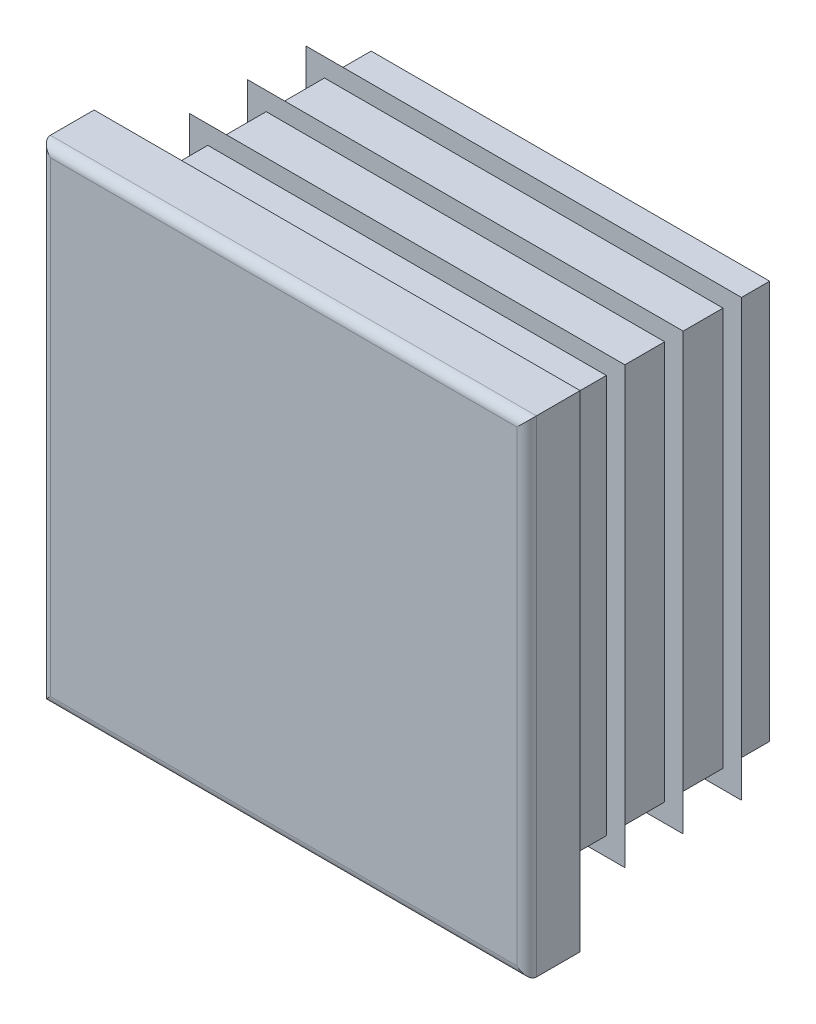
ISO-10303-21;
HEADER;
FILE_DESCRIPTION(('STEP AP214'),'2;1');
FILE_NAME('part.step','',(''),(''),'','','');
FILE_SCHEMA(('AUTOMOTIVE_DESIGN { 1 0 10303 214 1 1 1 1 }'));
ENDSEC;
DATA;
#1=APPLICATION_CONTEXT('core data for automotive mechanical design processes');
#2=APPLICATION_PROTOCOL_DEFINITION('international standard','automotive_design',2000,#1);
#3=PRODUCT_CONTEXT('',#1,'mechanical');
#4=PRODUCT('Part','Part','',(#3));
#5=PRODUCT_RELATED_PRODUCT_CATEGORY('part','',(#4));
#6=PRODUCT_DEFINITION_FORMATION('','',#4);
#7=PRODUCT_DEFINITION_CONTEXT('part definition',#1,'design');
#8=PRODUCT_DEFINITION('design','',#6,#7);
#9=PRODUCT_DEFINITION_SHAPE('','',#8);
#10=(LENGTH_UNIT() NAMED_UNIT(*) SI_UNIT(.MILLI.,.METRE.));
#11=(NAMED_UNIT(*) PLANE_ANGLE_UNIT() SI_UNIT($,.RADIAN.));
#12=(NAMED_UNIT(*) SI_UNIT($,.STERADIAN.) SOLID_ANGLE_UNIT());
#13=UNCERTAINTY_MEASURE_WITH_UNIT(LENGTH_MEASURE(1.E-05),#10,'distance_accuracy_value','');
#14=(GEOMETRIC_REPRESENTATION_CONTEXT(3) GLOBAL_UNCERTAINTY_ASSIGNED_CONTEXT((#13)) GLOBAL_UNIT_ASSIGNED_CONTEXT((#10,
#11,#12)) REPRESENTATION_CONTEXT('',''));
#15=CARTESIAN_POINT('',(0.,0.,0.));
#16=DIRECTION('',(0.,0.,1.));
#17=DIRECTION('',(1.,0.,0.));
#18=AXIS2_PLACEMENT_3D('',#15,#16,#17);
#19=CARTESIAN_POINT('',(24.,-25.,5.5));
#20=DIRECTION('',(0.,0.,-1.));
#21=DIRECTION('',(0.,1.,0.));
#22=AXIS2_PLACEMENT_3D('',#19,#20,#21);
#23=PLANE('',#22);
#24=DIRECTION('',(0.,1.,0.));
#25=VECTOR('',#24,1.);
#26=CARTESIAN_POINT('',(-24.,-25.,5.5));
#27=LINE('',#26,#25);
#28=CARTESIAN_POINT('',(-24.,-24.,5.5));
#29=VERTEX_POINT('',#28);
#30=CARTESIAN_POINT('',(-24.,24.,5.5));
#31=VERTEX_POINT('',#30);
#32=EDGE_CURVE('E262',#29,#31,#27,.T.);
#33=ORIENTED_EDGE('',*,*,#32,.F.);
#34=DIRECTION('',(-1.,0.,0.));
#35=VECTOR('',#34,1.);
#36=CARTESIAN_POINT('',(25.,-24.,5.5));
#37=LINE('',#36,#35);
#38=CARTESIAN_POINT('',(24.,-24.,5.5));
#39=VERTEX_POINT('',#38);
#40=EDGE_CURVE('E432',#39,#29,#37,.T.);
#41=ORIENTED_EDGE('',*,*,#40,.F.);
#42=DIRECTION('',(0.,1.,0.));
#43=VECTOR('',#42,1.);
#44=CARTESIAN_POINT('',(24.,-25.,5.5));
#45=LINE('',#44,#43);
#46=CARTESIAN_POINT('',(24.,24.,5.5));
#47=VERTEX_POINT('',#46);
#48=EDGE_CURVE('E257',#39,#47,#45,.T.);
#49=ORIENTED_EDGE('',*,*,#48,.T.);
#50=DIRECTION('',(-1.,0.,0.));
#51=VECTOR('',#50,1.);
#52=CARTESIAN_POINT('',(25.,24.,5.5));
#53=LINE('',#52,#51);
#54=EDGE_CURVE('E534',#47,#31,#53,.T.);
#55=ORIENTED_EDGE('',*,*,#54,.T.);
#56=EDGE_LOOP('',(#33,#41,#49,#55));
#57=FACE_BOUND('',#56,.T.);
#58=ADVANCED_FACE('F14',(#57),#23,.F.);
#59=CARTESIAN_POINT('',(-24.,-25.,4.5));
#60=DIRECTION('',(0.,1.,0.));
#61=DIRECTION('',(-1.,0.,0.));
#62=AXIS2_PLACEMENT_3D('',#59,#60,#61);
#63=CYLINDRICAL_SURFACE('',#62,1.);
#64=DIRECTION('',(0.,1.,0.));
#65=VECTOR('',#64,1.);
#66=CARTESIAN_POINT('',(-25.,-25.,4.5));
#67=LINE('',#66,#65);
#68=CARTESIAN_POINT('',(-25.,-25.,4.5));
#69=VERTEX_POINT('',#68);
#70=CARTESIAN_POINT('',(-25.,25.,4.5));
#71=VERTEX_POINT('',#70);
#72=EDGE_CURVE('E354',#69,#71,#67,.T.);
#73=ORIENTED_EDGE('',*,*,#72,.F.);
#74=CARTESIAN_POINT('',(-24.,-24.,4.5));
#75=DIRECTION('',(-0.707106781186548,0.707106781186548,0.));
#76=DIRECTION('',(0.707106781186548,0.707106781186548,0.));
#77=AXIS2_PLACEMENT_3D('',#74,#75,#76);
#78=ELLIPSE('',#77,1.4142135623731,1.);
#79=EDGE_CURVE('E59',#69,#29,#78,.T.);
#80=ORIENTED_EDGE('',*,*,#79,.T.);
#81=ORIENTED_EDGE('',*,*,#32,.T.);
#82=CARTESIAN_POINT('',(-24.,24.,4.5));
#83=DIRECTION('',(0.707106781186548,0.707106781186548,0.));
#84=DIRECTION('',(-0.707106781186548,0.707106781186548,0.));
#85=AXIS2_PLACEMENT_3D('',#82,#83,#84);
#86=ELLIPSE('',#85,1.4142135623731,1.);
#87=EDGE_CURVE('E258',#31,#71,#86,.F.);
#88=ORIENTED_EDGE('',*,*,#87,.T.);
#89=EDGE_LOOP('',(#73,#80,#81,#88));
#90=FACE_BOUND('',#89,.T.);
#91=ADVANCED_FACE('F16',(#90),#63,.T.);
#92=CARTESIAN_POINT('',(-25.,-25.,4.5));
#93=DIRECTION('',(1.,0.,0.));
#94=DIRECTION('',(0.,1.,0.));
#95=AXIS2_PLACEMENT_3D('',#92,#93,#94);
#96=PLANE('',#95);
#97=DIRECTION('',(0.,0.,-1.));
#98=VECTOR('',#97,1.);
#99=CARTESIAN_POINT('',(-25.,25.,4.5));
#100=LINE('',#99,#98);
#101=CARTESIAN_POINT('',(-25.,25.,0.));
#102=VERTEX_POINT('',#101);
#103=EDGE_CURVE('E519',#71,#102,#100,.T.);
#104=ORIENTED_EDGE('',*,*,#103,.T.);
#105=DIRECTION('',(0.,1.,0.));
#106=VECTOR('',#105,1.);
#107=CARTESIAN_POINT('',(-25.,-25.,0.));
#108=LINE('',#107,#106);
#109=CARTESIAN_POINT('',(-25.,-25.,0.));
#110=VERTEX_POINT('',#109);
#111=EDGE_CURVE('E352',#110,#102,#108,.T.);
#112=ORIENTED_EDGE('',*,*,#111,.F.);
#113=DIRECTION('',(0.,0.,-1.));
#114=VECTOR('',#113,1.);
#115=CARTESIAN_POINT('',(-25.,-25.,4.5));
#116=LINE('',#115,#114);
#117=EDGE_CURVE('E520',#69,#110,#116,.T.);
#118=ORIENTED_EDGE('',*,*,#117,.F.);
#119=ORIENTED_EDGE('',*,*,#72,.T.);
#120=EDGE_LOOP('',(#104,#112,#118,#119));
#121=FACE_BOUND('',#120,.T.);
#122=ADVANCED_FACE('F604',(#121),#96,.F.);
#123=CARTESIAN_POINT('',(-20.5,-25.,0.));
#124=DIRECTION('',(1.,0.,0.));
#125=DIRECTION('',(0.,1.,0.));
#126=AXIS2_PLACEMENT_3D('',#123,#124,#125);
#127=PLANE('',#126);
#128=DIRECTION('',(0.,1.,0.));
#129=VECTOR('',#128,1.);
#130=CARTESIAN_POINT('',(-20.5,-25.,0.));
#131=LINE('',#130,#129);
#132=CARTESIAN_POINT('',(-20.5,-20.5,0.));
#133=VERTEX_POINT('',#132);
#134=CARTESIAN_POINT('',(-20.5,20.5,0.));
#135=VERTEX_POINT('',#134);
#136=EDGE_CURVE('E349',#133,#135,#131,.T.);
#137=ORIENTED_EDGE('',*,*,#136,.T.);
#138=DIRECTION('',(0.,0.,-1.));
#139=VECTOR('',#138,1.);
#140=CARTESIAN_POINT('',(-20.5,20.5,0.));
#141=LINE('',#140,#139);
#142=CARTESIAN_POINT('',(-20.5,20.5,-1.2));
#143=VERTEX_POINT('',#142);
#144=EDGE_CURVE('E445',#135,#143,#141,.T.);
#145=ORIENTED_EDGE('',*,*,#144,.T.);
#146=DIRECTION('',(0.,1.,0.));
#147=VECTOR('',#146,1.);
#148=CARTESIAN_POINT('',(-20.5,-25.,-1.2));
#149=LINE('',#148,#147);
#150=CARTESIAN_POINT('',(-20.5,-20.5,-1.2));
#151=VERTEX_POINT('',#150);
#152=EDGE_CURVE('E346',#151,#143,#149,.T.);
#153=ORIENTED_EDGE('',*,*,#152,.F.);
#154=DIRECTION('',(0.,0.,1.));
#155=VECTOR('',#154,1.);
#156=CARTESIAN_POINT('',(-20.5,-20.5,0.));
#157=LINE('',#156,#155);
#158=EDGE_CURVE('E439',#151,#133,#157,.T.);
#159=ORIENTED_EDGE('',*,*,#158,.T.);
#160=EDGE_LOOP('',(#137,#145,#153,#159));
#161=FACE_BOUND('',#160,.T.);
#162=ADVANCED_FACE('F728',(#161),#127,.F.);
#163=CARTESIAN_POINT('',(-22.4,-25.,-1.2));
#164=DIRECTION('',(0.573576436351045,0.,0.819152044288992));
#165=DIRECTION('',(-0.819152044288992,0.,0.573576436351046));
#166=AXIS2_PLACEMENT_3D('',#163,#164,#165);
#167=PLANE('',#166);
#168=DIRECTION('',(0.,1.,0.));
#169=VECTOR('',#168,1.);
#170=CARTESIAN_POINT('',(-22.4,-25.,-1.2));
#171=LINE('',#170,#169);
#172=CARTESIAN_POINT('',(-22.4,-22.4,-1.2));
#173=VERTEX_POINT('',#172);
#174=CARTESIAN_POINT('',(-22.4,22.4,-1.2));
#175=VERTEX_POINT('',#174);
#176=EDGE_CURVE('E344',#173,#175,#171,.T.);
#177=ORIENTED_EDGE('',*,*,#176,.T.);
#178=DIRECTION('',(0.633687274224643,-0.633687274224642,-0.443712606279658));
#179=VECTOR('',#178,1.);
#180=CARTESIAN_POINT('',(-3.36607678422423,3.36607678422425,-14.527696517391));
#181=LINE('',#180,#179);
#182=CARTESIAN_POINT('',(-20.5,20.5,-2.53039432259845));
#183=VERTEX_POINT('',#182);
#184=EDGE_CURVE('E457',#175,#183,#181,.T.);
#185=ORIENTED_EDGE('',*,*,#184,.T.);
#186=DIRECTION('',(0.,1.,0.));
#187=VECTOR('',#186,1.);
#188=CARTESIAN_POINT('',(-20.5,-25.,-2.53039432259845));
#189=LINE('',#188,#187);
#190=CARTESIAN_POINT('',(-20.5,-20.5,-2.53039432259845));
#191=VERTEX_POINT('',#190);
#192=EDGE_CURVE('E341',#191,#183,#189,.T.);
#193=ORIENTED_EDGE('',*,*,#192,.F.);
#194=DIRECTION('',(-0.633687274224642,-0.633687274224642,0.443712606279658));
#195=VECTOR('',#194,1.);
#196=CARTESIAN_POINT('',(-23.444054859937,-23.444054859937,-0.468944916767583));
#197=LINE('',#196,#195);
#198=EDGE_CURVE('E451',#191,#173,#197,.T.);
#199=ORIENTED_EDGE('',*,*,#198,.T.);
#200=EDGE_LOOP('',(#177,#185,#193,#199));
#201=FACE_BOUND('',#200,.T.);
#202=ADVANCED_FACE('F732',(#201),#167,.F.);
#203=CARTESIAN_POINT('',(-20.5,-25.,-2.53039432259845));
#204=DIRECTION('',(1.,0.,0.));
#205=DIRECTION('',(0.,1.,0.));
#206=AXIS2_PLACEMENT_3D('',#203,#204,#205);
#207=PLANE('',#206);
#208=ORIENTED_EDGE('',*,*,#192,.T.);
#209=DIRECTION('',(0.,0.,-1.));
#210=VECTOR('',#209,1.);
#211=CARTESIAN_POINT('',(-20.5,20.5,-2.53039432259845));
#212=LINE('',#211,#210);
#213=CARTESIAN_POINT('',(-20.5,20.5,-7.2));
#214=VERTEX_POINT('',#213);
#215=EDGE_CURVE('E463',#183,#214,#212,.T.);
#216=ORIENTED_EDGE('',*,*,#215,.T.);
#217=DIRECTION('',(0.,1.,0.));
#218=VECTOR('',#217,1.);
#219=CARTESIAN_POINT('',(-20.5,-25.,-7.2));
#220=LINE('',#219,#218);
#221=CARTESIAN_POINT('',(-20.5,-20.5,-7.2));
#222=VERTEX_POINT('',#221);
#223=EDGE_CURVE('E338',#222,#214,#220,.T.);
#224=ORIENTED_EDGE('',*,*,#223,.F.);
#225=DIRECTION('',(0.,0.,1.));
#226=VECTOR('',#225,1.);
#227=CARTESIAN_POINT('',(-20.5,-20.5,-2.53039432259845));
#228=LINE('',#227,#226);
#229=EDGE_CURVE('E460',#222,#191,#228,.T.);
#230=ORIENTED_EDGE('',*,*,#229,.T.);
#231=EDGE_LOOP('',(#208,#216,#224,#230));
#232=FACE_BOUND('',#231,.T.);
#233=ADVANCED_FACE('F738',(#232),#207,.F.);
#234=CARTESIAN_POINT('',(-22.4,-25.,-7.2));
#235=DIRECTION('',(0.573576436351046,0.,0.819152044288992));
#236=DIRECTION('',(-0.819152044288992,0.,0.573576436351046));
#237=AXIS2_PLACEMENT_3D('',#234,#235,#236);
#238=PLANE('',#237);
#239=DIRECTION('',(0.,1.,0.));
#240=VECTOR('',#239,1.);
#241=CARTESIAN_POINT('',(-22.4,-25.,-7.2));
#242=LINE('',#241,#240);
#243=CARTESIAN_POINT('',(-22.4,-22.4,-7.2));
#244=VERTEX_POINT('',#243);
#245=CARTESIAN_POINT('',(-22.4,22.4,-7.2));
#246=VERTEX_POINT('',#245);
#247=EDGE_CURVE('E336',#244,#246,#242,.T.);
#248=ORIENTED_EDGE('',*,*,#247,.T.);
#249=DIRECTION('',(0.633687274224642,-0.633687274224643,-0.443712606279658));
#250=VECTOR('',#249,1.);
#251=CARTESIAN_POINT('',(-3.36607678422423,3.3660767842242,-20.527696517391));
#252=LINE('',#251,#250);
#253=CARTESIAN_POINT('',(-20.5,20.5,-8.53039432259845));
#254=VERTEX_POINT('',#253);
#255=EDGE_CURVE('E475',#246,#254,#252,.T.);
#256=ORIENTED_EDGE('',*,*,#255,.T.);
#257=DIRECTION('',(0.,1.,0.));
#258=VECTOR('',#257,1.);
#259=CARTESIAN_POINT('',(-20.5,-25.,-8.53039432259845));
#260=LINE('',#259,#258);
#261=CARTESIAN_POINT('',(-20.5,-20.5,-8.53039432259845));
#262=VERTEX_POINT('',#261);
#263=EDGE_CURVE('E333',#262,#254,#260,.T.);
#264=ORIENTED_EDGE('',*,*,#263,.F.);
#265=DIRECTION('',(-0.633687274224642,-0.633687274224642,0.443712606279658));
#266=VECTOR('',#265,1.);
#267=CARTESIAN_POINT('',(-23.444054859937,-23.444054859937,-6.46894491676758));
#268=LINE('',#267,#266);
#269=EDGE_CURVE('E469',#262,#244,#268,.T.);
#270=ORIENTED_EDGE('',*,*,#269,.T.);
#271=EDGE_LOOP('',(#248,#256,#264,#270));
#272=FACE_BOUND('',#271,.T.);
#273=ADVANCED_FACE('F742',(#272),#238,.F.);
#274=CARTESIAN_POINT('',(-20.5,-25.,-8.53039432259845));
#275=DIRECTION('',(1.,0.,0.));
#276=DIRECTION('',(0.,1.,0.));
#277=AXIS2_PLACEMENT_3D('',#274,#275,#276);
#278=PLANE('',#277);
#279=ORIENTED_EDGE('',*,*,#263,.T.);
#280=DIRECTION('',(0.,0.,-1.));
#281=VECTOR('',#280,1.);
#282=CARTESIAN_POINT('',(-20.5,20.5,-8.53039432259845));
#283=LINE('',#282,#281);
#284=CARTESIAN_POINT('',(-20.5,20.5,-13.2));
#285=VERTEX_POINT('',#284);
#286=EDGE_CURVE('E481',#254,#285,#283,.T.);
#287=ORIENTED_EDGE('',*,*,#286,.T.);
#288=DIRECTION('',(0.,1.,0.));
#289=VECTOR('',#288,1.);
#290=CARTESIAN_POINT('',(-20.5,-25.,-13.2));
#291=LINE('',#290,#289);
#292=CARTESIAN_POINT('',(-20.5,-20.5,-13.2));
#293=VERTEX_POINT('',#292);
#294=EDGE_CURVE('E330',#293,#285,#291,.T.);
#295=ORIENTED_EDGE('',*,*,#294,.F.);
#296=DIRECTION('',(0.,0.,1.));
#297=VECTOR('',#296,1.);
#298=CARTESIAN_POINT('',(-20.5,-20.5,-8.53039432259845));
#299=LINE('',#298,#297);
#300=EDGE_CURVE('E478',#293,#262,#299,.T.);
#301=ORIENTED_EDGE('',*,*,#300,.T.);
#302=EDGE_LOOP('',(#279,#287,#295,#301));
#303=FACE_BOUND('',#302,.T.);
#304=ADVANCED_FACE('F746',(#303),#278,.F.);
#305=CARTESIAN_POINT('',(-22.4,-25.,-13.2));
#306=DIRECTION('',(0.573576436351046,0.,0.819152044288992));
#307=DIRECTION('',(-0.819152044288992,0.,0.573576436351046));
#308=AXIS2_PLACEMENT_3D('',#305,#306,#307);
#309=PLANE('',#308);
#310=DIRECTION('',(0.,1.,0.));
#311=VECTOR('',#310,1.);
#312=CARTESIAN_POINT('',(-22.4,-25.,-13.2));
#313=LINE('',#312,#311);
#314=CARTESIAN_POINT('',(-22.4,-22.4,-13.2));
#315=VERTEX_POINT('',#314);
#316=CARTESIAN_POINT('',(-22.4,22.4,-13.2));
#317=VERTEX_POINT('',#316);
#318=EDGE_CURVE('E328',#315,#317,#313,.T.);
#319=ORIENTED_EDGE('',*,*,#318,.T.);
#320=DIRECTION('',(0.633687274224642,-0.633687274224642,-0.443712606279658));
#321=VECTOR('',#320,1.);
#322=CARTESIAN_POINT('',(-3.36607678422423,3.36607678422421,-26.527696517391));
#323=LINE('',#322,#321);
#324=CARTESIAN_POINT('',(-20.5,20.5,-14.5303943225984));
#325=VERTEX_POINT('',#324);
#326=EDGE_CURVE('E493',#317,#325,#323,.T.);
#327=ORIENTED_EDGE('',*,*,#326,.T.);
#328=DIRECTION('',(0.,1.,0.));
#329=VECTOR('',#328,1.);
#330=CARTESIAN_POINT('',(-20.5,-25.,-14.5303943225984));
#331=LINE('',#330,#329);
#332=CARTESIAN_POINT('',(-20.5,-20.5,-14.5303943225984));
#333=VERTEX_POINT('',#332);
#334=EDGE_CURVE('E325',#333,#325,#331,.T.);
#335=ORIENTED_EDGE('',*,*,#334,.F.);
#336=DIRECTION('',(-0.633687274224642,-0.633687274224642,0.443712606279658));
#337=VECTOR('',#336,1.);
#338=CARTESIAN_POINT('',(-23.444054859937,-23.444054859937,-12.4689449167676));
#339=LINE('',#338,#337);
#340=EDGE_CURVE('E487',#333,#315,#339,.T.);
#341=ORIENTED_EDGE('',*,*,#340,.T.);
#342=EDGE_LOOP('',(#319,#327,#335,#341));
#343=FACE_BOUND('',#342,.T.);
#344=ADVANCED_FACE('F668',(#343),#309,.F.);
#345=CARTESIAN_POINT('',(-20.5,-25.,-14.5303943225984));
#346=DIRECTION('',(1.,0.,0.));
#347=DIRECTION('',(0.,1.,0.));
#348=AXIS2_PLACEMENT_3D('',#345,#346,#347);
#349=PLANE('',#348);
#350=ORIENTED_EDGE('',*,*,#334,.T.);
#351=DIRECTION('',(0.,0.,-1.));
#352=VECTOR('',#351,1.);
#353=CARTESIAN_POINT('',(-20.5,20.5,-14.5303943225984));
#354=LINE('',#353,#352);
#355=CARTESIAN_POINT('',(-20.5,20.5,-19.2));
#356=VERTEX_POINT('',#355);
#357=EDGE_CURVE('E499',#325,#356,#354,.T.);
#358=ORIENTED_EDGE('',*,*,#357,.T.);
#359=DIRECTION('',(0.,1.,0.));
#360=VECTOR('',#359,1.);
#361=CARTESIAN_POINT('',(-20.5,-25.,-19.2));
#362=LINE('',#361,#360);
#363=CARTESIAN_POINT('',(-20.5,-20.5,-19.2));
#364=VERTEX_POINT('',#363);
#365=EDGE_CURVE('E322',#364,#356,#362,.T.);
#366=ORIENTED_EDGE('',*,*,#365,.F.);
#367=DIRECTION('',(0.,0.,1.));
#368=VECTOR('',#367,1.);
#369=CARTESIAN_POINT('',(-20.5,-20.5,-14.5303943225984));
#370=LINE('',#369,#368);
#371=EDGE_CURVE('E496',#364,#333,#370,.T.);
#372=ORIENTED_EDGE('',*,*,#371,.T.);
#373=EDGE_LOOP('',(#350,#358,#366,#372));
#374=FACE_BOUND('',#373,.T.);
#375=ADVANCED_FACE('F665',(#374),#349,.F.);
#376=CARTESIAN_POINT('',(-22.4,-25.,-19.2));
#377=DIRECTION('',(0.573576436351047,0.,0.819152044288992));
#378=DIRECTION('',(-0.819152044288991,0.,0.573576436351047));
#379=AXIS2_PLACEMENT_3D('',#376,#377,#378);
#380=PLANE('',#379);
#381=DIRECTION('',(0.,1.,0.));
#382=VECTOR('',#381,1.);
#383=CARTESIAN_POINT('',(-22.4,-25.,-19.2));
#384=LINE('',#383,#382);
#385=CARTESIAN_POINT('',(-22.4,-22.4,-19.2));
#386=VERTEX_POINT('',#385);
#387=CARTESIAN_POINT('',(-22.4,22.4,-19.2));
#388=VERTEX_POINT('',#387);
#389=EDGE_CURVE('E320',#386,#388,#384,.T.);
#390=ORIENTED_EDGE('',*,*,#389,.T.);
#391=DIRECTION('',(0.633687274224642,-0.633687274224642,-0.443712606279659));
#392=VECTOR('',#391,1.);
#393=CARTESIAN_POINT('',(-3.36607678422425,3.36607678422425,-32.527696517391));
#394=LINE('',#393,#392);
#395=CARTESIAN_POINT('',(-20.5,20.5,-20.5303943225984));
#396=VERTEX_POINT('',#395);
#397=EDGE_CURVE('E511',#388,#396,#394,.T.);
#398=ORIENTED_EDGE('',*,*,#397,.T.);
#399=DIRECTION('',(0.,1.,0.));
#400=VECTOR('',#399,1.);
#401=CARTESIAN_POINT('',(-20.5,-25.,-20.5303943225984));
#402=LINE('',#401,#400);
#403=CARTESIAN_POINT('',(-20.5,-20.5,-20.5303943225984));
#404=VERTEX_POINT('',#403);
#405=EDGE_CURVE('E317',#404,#396,#402,.T.);
#406=ORIENTED_EDGE('',*,*,#405,.F.);
#407=DIRECTION('',(-0.633687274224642,-0.633687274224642,0.443712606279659));
#408=VECTOR('',#407,1.);
#409=CARTESIAN_POINT('',(-23.444054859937,-23.444054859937,-18.4689449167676));
#410=LINE('',#409,#408);
#411=EDGE_CURVE('E505',#404,#386,#410,.T.);
#412=ORIENTED_EDGE('',*,*,#411,.T.);
#413=EDGE_LOOP('',(#390,#398,#406,#412));
#414=FACE_BOUND('',#413,.T.);
#415=ADVANCED_FACE('F580',(#414),#380,.F.);
#416=CARTESIAN_POINT('',(-20.5,-25.,-20.5303943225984));
#417=DIRECTION('',(1.,0.,0.));
#418=DIRECTION('',(0.,1.,0.));
#419=AXIS2_PLACEMENT_3D('',#416,#417,#418);
#420=PLANE('',#419);
#421=ORIENTED_EDGE('',*,*,#405,.T.);
#422=DIRECTION('',(0.,0.,-1.));
#423=VECTOR('',#422,1.);
#424=CARTESIAN_POINT('',(-20.5,20.5,-20.5303943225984));
#425=LINE('',#424,#423);
#426=CARTESIAN_POINT('',(-20.5,20.5,-24.));
#427=VERTEX_POINT('',#426);
#428=EDGE_CURVE('E517',#396,#427,#425,.T.);
#429=ORIENTED_EDGE('',*,*,#428,.T.);
#430=DIRECTION('',(0.,1.,0.));
#431=VECTOR('',#430,1.);
#432=CARTESIAN_POINT('',(-20.5,-25.,-24.));
#433=LINE('',#432,#431);
#434=CARTESIAN_POINT('',(-20.5,-20.5,-24.));
#435=VERTEX_POINT('',#434);
#436=EDGE_CURVE('E314',#435,#427,#433,.T.);
#437=ORIENTED_EDGE('',*,*,#436,.F.);
#438=DIRECTION('',(0.,0.,1.));
#439=VECTOR('',#438,1.);
#440=CARTESIAN_POINT('',(-20.5,-20.5,-20.5303943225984));
#441=LINE('',#440,#439);
#442=EDGE_CURVE('E514',#435,#404,#441,.T.);
#443=ORIENTED_EDGE('',*,*,#442,.T.);
#444=EDGE_LOOP('',(#421,#429,#437,#443));
#445=FACE_BOUND('',#444,.T.);
#446=ADVANCED_FACE('F582',(#445),#420,.F.);
#447=CARTESIAN_POINT('',(-20.5,-25.,-24.));
#448=DIRECTION('',(0.,0.,1.));
#449=DIRECTION('',(0.,-1.,0.));
#450=AXIS2_PLACEMENT_3D('',#447,#448,#449);
#451=PLANE('',#450);
#452=ORIENTED_EDGE('',*,*,#436,.T.);
#453=DIRECTION('',(-1.,0.,0.));
#454=VECTOR('',#453,1.);
#455=CARTESIAN_POINT('',(25.,20.5,-24.));
#456=LINE('',#455,#454);
#457=CARTESIAN_POINT('',(20.5,20.5,-24.));
#458=VERTEX_POINT('',#457);
#459=EDGE_CURVE('E388',#458,#427,#456,.T.);
#460=ORIENTED_EDGE('',*,*,#459,.F.);
#461=DIRECTION('',(0.,1.,0.));
#462=VECTOR('',#461,1.);
#463=CARTESIAN_POINT('',(20.5,-25.,-24.));
#464=LINE('',#463,#462);
#465=CARTESIAN_POINT('',(20.5,-20.5,-24.));
#466=VERTEX_POINT('',#465);
#467=EDGE_CURVE('E311',#466,#458,#464,.T.);
#468=ORIENTED_EDGE('',*,*,#467,.F.);
#469=DIRECTION('',(-1.,0.,0.));
#470=VECTOR('',#469,1.);
#471=CARTESIAN_POINT('',(25.,-20.5,-24.));
#472=LINE('',#471,#470);
#473=EDGE_CURVE('E386',#466,#435,#472,.T.);
#474=ORIENTED_EDGE('',*,*,#473,.T.);
#475=EDGE_LOOP('',(#452,#460,#468,#474));
#476=FACE_BOUND('',#475,.T.);
#477=ADVANCED_FACE('F385',(#476),#451,.F.);
#478=CARTESIAN_POINT('',(20.5,-25.,-24.));
#479=DIRECTION('',(-1.,0.,0.));
#480=DIRECTION('',(0.,-1.,0.));
#481=AXIS2_PLACEMENT_3D('',#478,#479,#480);
#482=PLANE('',#481);
#483=ORIENTED_EDGE('',*,*,#467,.T.);
#484=DIRECTION('',(0.,0.,1.));
#485=VECTOR('',#484,1.);
#486=CARTESIAN_POINT('',(20.5,20.5,-24.));
#487=LINE('',#486,#485);
#488=CARTESIAN_POINT('',(20.5,20.5,-20.5303943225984));
#489=VERTEX_POINT('',#488);
#490=EDGE_CURVE('E9',#458,#489,#487,.T.);
#491=ORIENTED_EDGE('',*,*,#490,.T.);
#492=DIRECTION('',(0.,1.,0.));
#493=VECTOR('',#492,1.);
#494=CARTESIAN_POINT('',(20.5,-25.,-20.5303943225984));
#495=LINE('',#494,#493);
#496=CARTESIAN_POINT('',(20.5,-20.5,-20.5303943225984));
#497=VERTEX_POINT('',#496);
#498=EDGE_CURVE('E308',#497,#489,#495,.T.);
#499=ORIENTED_EDGE('',*,*,#498,.F.);
#500=DIRECTION('',(0.,0.,-1.));
#501=VECTOR('',#500,1.);
#502=CARTESIAN_POINT('',(20.5,-20.5,-24.));
#503=LINE('',#502,#501);
#504=EDGE_CURVE('E23',#497,#466,#503,.T.);
#505=ORIENTED_EDGE('',*,*,#504,.T.);
#506=EDGE_LOOP('',(#483,#491,#499,#505));
#507=FACE_BOUND('',#506,.T.);
#508=ADVANCED_FACE('F378',(#507),#482,.F.);
#509=CARTESIAN_POINT('',(20.5,-25.,-20.5303943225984));
#510=DIRECTION('',(-0.573576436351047,0.,0.819152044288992));
#511=DIRECTION('',(-0.819152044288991,0.,-0.573576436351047));
#512=AXIS2_PLACEMENT_3D('',#509,#510,#511);
#513=PLANE('',#512);
#514=ORIENTED_EDGE('',*,*,#498,.T.);
#515=DIRECTION('',(0.633687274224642,0.633687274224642,0.443712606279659));
#516=VECTOR('',#515,1.);
#517=CARTESIAN_POINT('',(2.22903995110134,2.22903995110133,-33.3238582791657));
#518=LINE('',#517,#516);
#519=CARTESIAN_POINT('',(22.4,22.4,-19.2));
#520=VERTEX_POINT('',#519);
#521=EDGE_CURVE('E508',#489,#520,#518,.T.);
#522=ORIENTED_EDGE('',*,*,#521,.T.);
#523=DIRECTION('',(0.,1.,0.));
#524=VECTOR('',#523,1.);
#525=CARTESIAN_POINT('',(22.4,-25.,-19.2));
#526=LINE('',#525,#524);
#527=CARTESIAN_POINT('',(22.4,-22.4,-19.2));
#528=VERTEX_POINT('',#527);
#529=EDGE_CURVE('E305',#528,#520,#526,.T.);
#530=ORIENTED_EDGE('',*,*,#529,.F.);
#531=DIRECTION('',(-0.633687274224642,0.633687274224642,-0.443712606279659));
#532=VECTOR('',#531,1.);
#533=CARTESIAN_POINT('',(22.3070180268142,-22.3070180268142,-19.2651066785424));
#534=LINE('',#533,#532);
#535=EDGE_CURVE('E502',#528,#497,#534,.T.);
#536=ORIENTED_EDGE('',*,*,#535,.T.);
#537=EDGE_LOOP('',(#514,#522,#530,#536));
#538=FACE_BOUND('',#537,.T.);
#539=ADVANCED_FACE('F588',(#538),#513,.F.);
#540=CARTESIAN_POINT('',(22.4,-25.,-19.2));
#541=DIRECTION('',(0.,0.,-1.));
#542=DIRECTION('',(0.,1.,0.));
#543=AXIS2_PLACEMENT_3D('',#540,#541,#542);
#544=PLANE('',#543);
#545=ORIENTED_EDGE('',*,*,#529,.T.);
#546=DIRECTION('',(-1.,0.,0.));
#547=VECTOR('',#546,1.);
#548=CARTESIAN_POINT('',(25.,22.4,-19.2));
#549=LINE('',#548,#547);
#550=EDGE_CURVE('E394',#520,#388,#549,.T.);
#551=ORIENTED_EDGE('',*,*,#550,.T.);
#552=ORIENTED_EDGE('',*,*,#389,.F.);
#553=DIRECTION('',(-1.,0.,0.));
#554=VECTOR('',#553,1.);
#555=CARTESIAN_POINT('',(25.,-22.4,-19.2));
#556=LINE('',#555,#554);
#557=EDGE_CURVE('E401',#528,#386,#556,.T.);
#558=ORIENTED_EDGE('',*,*,#557,.F.);
#559=EDGE_LOOP('',(#545,#551,#552,#558));
#560=FACE_BOUND('',#559,.T.);
#561=ORIENTED_EDGE('',*,*,#365,.T.);
#562=DIRECTION('',(-1.,0.,0.));
#563=VECTOR('',#562,1.);
#564=CARTESIAN_POINT('',(25.,20.5,-19.2));
#565=LINE('',#564,#563);
#566=CARTESIAN_POINT('',(20.5,20.5,-19.2));
#567=VERTEX_POINT('',#566);
#568=EDGE_CURVE('E567',#567,#356,#565,.T.);
#569=ORIENTED_EDGE('',*,*,#568,.F.);
#570=DIRECTION('',(0.,1.,0.));
#571=VECTOR('',#570,1.);
#572=CARTESIAN_POINT('',(20.5,-25.,-19.2));
#573=LINE('',#572,#571);
#574=CARTESIAN_POINT('',(20.5,-20.5,-19.2));
#575=VERTEX_POINT('',#574);
#576=EDGE_CURVE('E302',#575,#567,#573,.T.);
#577=ORIENTED_EDGE('',*,*,#576,.F.);
#578=DIRECTION('',(-1.,0.,0.));
#579=VECTOR('',#578,1.);
#580=CARTESIAN_POINT('',(25.,-20.5,-19.2));
#581=LINE('',#580,#579);
#582=EDGE_CURVE('E403',#575,#364,#581,.T.);
#583=ORIENTED_EDGE('',*,*,#582,.T.);
#584=EDGE_LOOP('',(#561,#569,#577,#583));
#585=FACE_BOUND('',#584,.T.);
#586=ADVANCED_FACE('F571',(#560,#585),#544,.F.);
#587=CARTESIAN_POINT('',(20.5,-25.,-19.2));
#588=DIRECTION('',(-1.,0.,0.));
#589=DIRECTION('',(0.,-1.,0.));
#590=AXIS2_PLACEMENT_3D('',#587,#588,#589);
#591=PLANE('',#590);
#592=ORIENTED_EDGE('',*,*,#576,.T.);
#593=DIRECTION('',(0.,0.,1.));
#594=VECTOR('',#593,1.);
#595=CARTESIAN_POINT('',(20.5,20.5,-19.2));
#596=LINE('',#595,#594);
#597=CARTESIAN_POINT('',(20.5,20.5,-14.5303943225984));
#598=VERTEX_POINT('',#597);
#599=EDGE_CURVE('E372',#567,#598,#596,.T.);
#600=ORIENTED_EDGE('',*,*,#599,.T.);
#601=DIRECTION('',(0.,1.,0.));
#602=VECTOR('',#601,1.);
#603=CARTESIAN_POINT('',(20.5,-25.,-14.5303943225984));
#604=LINE('',#603,#602);
#605=CARTESIAN_POINT('',(20.5,-20.5,-14.5303943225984));
#606=VERTEX_POINT('',#605);
#607=EDGE_CURVE('E299',#606,#598,#604,.T.);
#608=ORIENTED_EDGE('',*,*,#607,.F.);
#609=DIRECTION('',(0.,0.,-1.));
#610=VECTOR('',#609,1.);
#611=CARTESIAN_POINT('',(20.5,-20.5,-19.2));
#612=LINE('',#611,#610);
#613=EDGE_CURVE('E369',#606,#575,#612,.T.);
#614=ORIENTED_EDGE('',*,*,#613,.T.);
#615=EDGE_LOOP('',(#592,#600,#608,#614));
#616=FACE_BOUND('',#615,.T.);
#617=ADVANCED_FACE('F596',(#616),#591,.F.);
#618=CARTESIAN_POINT('',(20.5,-25.,-14.5303943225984));
#619=DIRECTION('',(-0.573576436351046,0.,0.819152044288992));
#620=DIRECTION('',(-0.819152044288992,0.,-0.573576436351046));
#621=AXIS2_PLACEMENT_3D('',#618,#619,#620);
#622=PLANE('',#621);
#623=ORIENTED_EDGE('',*,*,#607,.T.);
#624=DIRECTION('',(0.633687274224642,0.633687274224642,0.443712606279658));
#625=VECTOR('',#624,1.);
#626=CARTESIAN_POINT('',(2.22903995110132,2.22903995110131,-27.3238582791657));
#627=LINE('',#626,#625);
#628=CARTESIAN_POINT('',(22.4,22.4,-13.2));
#629=VERTEX_POINT('',#628);
#630=EDGE_CURVE('E490',#598,#629,#627,.T.);
#631=ORIENTED_EDGE('',*,*,#630,.T.);
#632=DIRECTION('',(0.,1.,0.));
#633=VECTOR('',#632,1.);
#634=CARTESIAN_POINT('',(22.4,-25.,-13.2));
#635=LINE('',#634,#633);
#636=CARTESIAN_POINT('',(22.4,-22.4,-13.2));
#637=VERTEX_POINT('',#636);
#638=EDGE_CURVE('E296',#637,#629,#635,.T.);
#639=ORIENTED_EDGE('',*,*,#638,.F.);
#640=DIRECTION('',(-0.633687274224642,0.633687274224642,-0.443712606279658));
#641=VECTOR('',#640,1.);
#642=CARTESIAN_POINT('',(22.3070180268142,-22.3070180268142,-13.2651066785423));
#643=LINE('',#642,#641);
#644=EDGE_CURVE('E484',#637,#606,#643,.T.);
#645=ORIENTED_EDGE('',*,*,#644,.T.);
#646=EDGE_LOOP('',(#623,#631,#639,#645));
#647=FACE_BOUND('',#646,.T.);
#648=ADVANCED_FACE('F648',(#647),#622,.F.);
#649=CARTESIAN_POINT('',(22.4,-25.,-13.2));
#650=DIRECTION('',(0.,0.,-1.));
#651=DIRECTION('',(0.,1.,0.));
#652=AXIS2_PLACEMENT_3D('',#649,#650,#651);
#653=PLANE('',#652);
#654=ORIENTED_EDGE('',*,*,#638,.T.);
#655=DIRECTION('',(-1.,0.,0.));
#656=VECTOR('',#655,1.);
#657=CARTESIAN_POINT('',(25.,22.4,-13.2));
#658=LINE('',#657,#656);
#659=EDGE_CURVE('E561',#629,#317,#658,.T.);
#660=ORIENTED_EDGE('',*,*,#659,.T.);
#661=ORIENTED_EDGE('',*,*,#318,.F.);
#662=DIRECTION('',(-1.,0.,0.));
#663=VECTOR('',#662,1.);
#664=CARTESIAN_POINT('',(25.,-22.4,-13.2));
#665=LINE('',#664,#663);
#666=EDGE_CURVE('E409',#637,#315,#665,.T.);
#667=ORIENTED_EDGE('',*,*,#666,.F.);
#668=EDGE_LOOP('',(#654,#660,#661,#667));
#669=FACE_BOUND('',#668,.T.);
#670=ORIENTED_EDGE('',*,*,#294,.T.);
#671=DIRECTION('',(-1.,0.,0.));
#672=VECTOR('',#671,1.);
#673=CARTESIAN_POINT('',(25.,20.5,-13.2));
#674=LINE('',#673,#672);
#675=CARTESIAN_POINT('',(20.5,20.5,-13.2));
#676=VERTEX_POINT('',#675);
#677=EDGE_CURVE('E559',#676,#285,#674,.T.);
#678=ORIENTED_EDGE('',*,*,#677,.F.);
#679=DIRECTION('',(0.,1.,0.));
#680=VECTOR('',#679,1.);
#681=CARTESIAN_POINT('',(20.5,-25.,-13.2));
#682=LINE('',#681,#680);
#683=CARTESIAN_POINT('',(20.5,-20.5,-13.2));
#684=VERTEX_POINT('',#683);
#685=EDGE_CURVE('E293',#684,#676,#682,.T.);
#686=ORIENTED_EDGE('',*,*,#685,.F.);
#687=DIRECTION('',(-1.,0.,0.));
#688=VECTOR('',#687,1.);
#689=CARTESIAN_POINT('',(25.,-20.5,-13.2));
#690=LINE('',#689,#688);
#691=EDGE_CURVE('E411',#684,#293,#690,.T.);
#692=ORIENTED_EDGE('',*,*,#691,.T.);
#693=EDGE_LOOP('',(#670,#678,#686,#692));
#694=FACE_BOUND('',#693,.T.);
#695=ADVANCED_FACE('F644',(#669,#694),#653,.F.);
#696=CARTESIAN_POINT('',(20.5,-25.,-13.2));
#697=DIRECTION('',(-1.,0.,0.));
#698=DIRECTION('',(0.,-1.,0.));
#699=AXIS2_PLACEMENT_3D('',#696,#697,#698);
#700=PLANE('',#699);
#701=ORIENTED_EDGE('',*,*,#685,.T.);
#702=DIRECTION('',(0.,0.,1.));
#703=VECTOR('',#702,1.);
#704=CARTESIAN_POINT('',(20.5,20.5,-13.2));
#705=LINE('',#704,#703);
#706=CARTESIAN_POINT('',(20.5,20.5,-8.53039432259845));
#707=VERTEX_POINT('',#706);
#708=EDGE_CURVE('E366',#676,#707,#705,.T.);
#709=ORIENTED_EDGE('',*,*,#708,.T.);
#710=DIRECTION('',(0.,1.,0.));
#711=VECTOR('',#710,1.);
#712=CARTESIAN_POINT('',(20.5,-25.,-8.53039432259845));
#713=LINE('',#712,#711);
#714=CARTESIAN_POINT('',(20.5,-20.5,-8.53039432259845));
#715=VERTEX_POINT('',#714);
#716=EDGE_CURVE('E290',#715,#707,#713,.T.);
#717=ORIENTED_EDGE('',*,*,#716,.F.);
#718=DIRECTION('',(0.,0.,-1.));
#719=VECTOR('',#718,1.);
#720=CARTESIAN_POINT('',(20.5,-20.5,-13.2));
#721=LINE('',#720,#719);
#722=EDGE_CURVE('E363',#715,#684,#721,.T.);
#723=ORIENTED_EDGE('',*,*,#722,.T.);
#724=EDGE_LOOP('',(#701,#709,#717,#723));
#725=FACE_BOUND('',#724,.T.);
#726=ADVANCED_FACE('F640',(#725),#700,.F.);
#727=CARTESIAN_POINT('',(20.5,-25.,-8.53039432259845));
#728=DIRECTION('',(-0.573576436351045,0.,0.819152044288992));
#729=DIRECTION('',(-0.819152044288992,0.,-0.573576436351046));
#730=AXIS2_PLACEMENT_3D('',#727,#728,#729);
#731=PLANE('',#730);
#732=ORIENTED_EDGE('',*,*,#716,.T.);
#733=DIRECTION('',(0.633687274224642,0.633687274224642,0.443712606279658));
#734=VECTOR('',#733,1.);
#735=CARTESIAN_POINT('',(2.22903995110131,2.22903995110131,-21.3238582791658));
#736=LINE('',#735,#734);
#737=CARTESIAN_POINT('',(22.4,22.4,-7.2));
#738=VERTEX_POINT('',#737);
#739=EDGE_CURVE('E472',#707,#738,#736,.T.);
#740=ORIENTED_EDGE('',*,*,#739,.T.);
#741=DIRECTION('',(0.,1.,0.));
#742=VECTOR('',#741,1.);
#743=CARTESIAN_POINT('',(22.4,-25.,-7.2));
#744=LINE('',#743,#742);
#745=CARTESIAN_POINT('',(22.4,-22.4,-7.2));
#746=VERTEX_POINT('',#745);
#747=EDGE_CURVE('E287',#746,#738,#744,.T.);
#748=ORIENTED_EDGE('',*,*,#747,.F.);
#749=DIRECTION('',(-0.633687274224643,0.633687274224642,-0.443712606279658));
#750=VECTOR('',#749,1.);
#751=CARTESIAN_POINT('',(22.3070180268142,-22.3070180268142,-7.26510667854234));
#752=LINE('',#751,#750);
#753=EDGE_CURVE('E466',#746,#715,#752,.T.);
#754=ORIENTED_EDGE('',*,*,#753,.T.);
#755=EDGE_LOOP('',(#732,#740,#748,#754));
#756=FACE_BOUND('',#755,.T.);
#757=ADVANCED_FACE('F636',(#756),#731,.F.);
#758=CARTESIAN_POINT('',(22.4,-25.,-7.2));
#759=DIRECTION('',(0.,0.,-1.));
#760=DIRECTION('',(0.,1.,0.));
#761=AXIS2_PLACEMENT_3D('',#758,#759,#760);
#762=PLANE('',#761);
#763=ORIENTED_EDGE('',*,*,#747,.T.);
#764=DIRECTION('',(-1.,0.,0.));
#765=VECTOR('',#764,1.);
#766=CARTESIAN_POINT('',(25.,22.4,-7.2));
#767=LINE('',#766,#765);
#768=EDGE_CURVE('E553',#738,#246,#767,.T.);
#769=ORIENTED_EDGE('',*,*,#768,.T.);
#770=ORIENTED_EDGE('',*,*,#247,.F.);
#771=DIRECTION('',(-1.,0.,0.));
#772=VECTOR('',#771,1.);
#773=CARTESIAN_POINT('',(25.,-22.4,-7.2));
#774=LINE('',#773,#772);
#775=EDGE_CURVE('E417',#746,#244,#774,.T.);
#776=ORIENTED_EDGE('',*,*,#775,.F.);
#777=EDGE_LOOP('',(#763,#769,#770,#776));
#778=FACE_BOUND('',#777,.T.);
#779=ORIENTED_EDGE('',*,*,#223,.T.);
#780=DIRECTION('',(-1.,0.,0.));
#781=VECTOR('',#780,1.);
#782=CARTESIAN_POINT('',(25.,20.5,-7.2));
#783=LINE('',#782,#781);
#784=CARTESIAN_POINT('',(20.5,20.5,-7.2));
#785=VERTEX_POINT('',#784);
#786=EDGE_CURVE('E551',#785,#214,#783,.T.);
#787=ORIENTED_EDGE('',*,*,#786,.F.);
#788=DIRECTION('',(0.,1.,0.));
#789=VECTOR('',#788,1.);
#790=CARTESIAN_POINT('',(20.5,-25.,-7.2));
#791=LINE('',#790,#789);
#792=CARTESIAN_POINT('',(20.5,-20.5,-7.2));
#793=VERTEX_POINT('',#792);
#794=EDGE_CURVE('E284',#793,#785,#791,.T.);
#795=ORIENTED_EDGE('',*,*,#794,.F.);
#796=DIRECTION('',(-1.,0.,0.));
#797=VECTOR('',#796,1.);
#798=CARTESIAN_POINT('',(25.,-20.5,-7.2));
#799=LINE('',#798,#797);
#800=EDGE_CURVE('E419',#793,#222,#799,.T.);
#801=ORIENTED_EDGE('',*,*,#800,.T.);
#802=EDGE_LOOP('',(#779,#787,#795,#801));
#803=FACE_BOUND('',#802,.T.);
#804=ADVANCED_FACE('F632',(#778,#803),#762,.F.);
#805=CARTESIAN_POINT('',(20.5,-25.,-7.2));
#806=DIRECTION('',(-1.,0.,0.));
#807=DIRECTION('',(0.,-1.,0.));
#808=AXIS2_PLACEMENT_3D('',#805,#806,#807);
#809=PLANE('',#808);
#810=ORIENTED_EDGE('',*,*,#794,.T.);
#811=DIRECTION('',(0.,0.,1.));
#812=VECTOR('',#811,1.);
#813=CARTESIAN_POINT('',(20.5,20.5,-7.2));
#814=LINE('',#813,#812);
#815=CARTESIAN_POINT('',(20.5,20.5,-2.53039432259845));
#816=VERTEX_POINT('',#815);
#817=EDGE_CURVE('E360',#785,#816,#814,.T.);
#818=ORIENTED_EDGE('',*,*,#817,.T.);
#819=DIRECTION('',(0.,1.,0.));
#820=VECTOR('',#819,1.);
#821=CARTESIAN_POINT('',(20.5,-25.,-2.53039432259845));
#822=LINE('',#821,#820);
#823=CARTESIAN_POINT('',(20.5,-20.5,-2.53039432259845));
#824=VERTEX_POINT('',#823);
#825=EDGE_CURVE('E281',#824,#816,#822,.T.);
#826=ORIENTED_EDGE('',*,*,#825,.F.);
#827=DIRECTION('',(0.,0.,-1.));
#828=VECTOR('',#827,1.);
#829=CARTESIAN_POINT('',(20.5,-20.5,-7.2));
#830=LINE('',#829,#828);
#831=EDGE_CURVE('E357',#824,#793,#830,.T.);
#832=ORIENTED_EDGE('',*,*,#831,.T.);
#833=EDGE_LOOP('',(#810,#818,#826,#832));
#834=FACE_BOUND('',#833,.T.);
#835=ADVANCED_FACE('F628',(#834),#809,.F.);
#836=CARTESIAN_POINT('',(20.5,-25.,-2.53039432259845));
#837=DIRECTION('',(-0.573576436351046,0.,0.819152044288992));
#838=DIRECTION('',(-0.819152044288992,0.,-0.573576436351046));
#839=AXIS2_PLACEMENT_3D('',#836,#837,#838);
#840=PLANE('',#839);
#841=ORIENTED_EDGE('',*,*,#825,.T.);
#842=DIRECTION('',(0.633687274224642,0.633687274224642,0.443712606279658));
#843=VECTOR('',#842,1.);
#844=CARTESIAN_POINT('',(2.22903995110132,2.22903995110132,-15.3238582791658));
#845=LINE('',#844,#843);
#846=CARTESIAN_POINT('',(22.4,22.4,-1.2));
#847=VERTEX_POINT('',#846);
#848=EDGE_CURVE('E454',#816,#847,#845,.T.);
#849=ORIENTED_EDGE('',*,*,#848,.T.);
#850=DIRECTION('',(0.,1.,0.));
#851=VECTOR('',#850,1.);
#852=CARTESIAN_POINT('',(22.4,-25.,-1.2));
#853=LINE('',#852,#851);
#854=CARTESIAN_POINT('',(22.4,-22.4,-1.2));
#855=VERTEX_POINT('',#854);
#856=EDGE_CURVE('E278',#855,#847,#853,.T.);
#857=ORIENTED_EDGE('',*,*,#856,.F.);
#858=DIRECTION('',(-0.633687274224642,0.633687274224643,-0.443712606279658));
#859=VECTOR('',#858,1.);
#860=CARTESIAN_POINT('',(22.3070180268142,-22.3070180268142,-1.26510667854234));
#861=LINE('',#860,#859);
#862=EDGE_CURVE('E448',#855,#824,#861,.T.);
#863=ORIENTED_EDGE('',*,*,#862,.T.);
#864=EDGE_LOOP('',(#841,#849,#857,#863));
#865=FACE_BOUND('',#864,.T.);
#866=ADVANCED_FACE('F624',(#865),#840,.F.);
#867=CARTESIAN_POINT('',(22.4,-25.,-1.2));
#868=DIRECTION('',(0.,0.,-1.));
#869=DIRECTION('',(0.,1.,0.));
#870=AXIS2_PLACEMENT_3D('',#867,#868,#869);
#871=PLANE('',#870);
#872=ORIENTED_EDGE('',*,*,#856,.T.);
#873=DIRECTION('',(-1.,0.,0.));
#874=VECTOR('',#873,1.);
#875=CARTESIAN_POINT('',(25.,22.4,-1.2));
#876=LINE('',#875,#874);
#877=EDGE_CURVE('E545',#847,#175,#876,.T.);
#878=ORIENTED_EDGE('',*,*,#877,.T.);
#879=ORIENTED_EDGE('',*,*,#176,.F.);
#880=DIRECTION('',(-1.,0.,0.));
#881=VECTOR('',#880,1.);
#882=CARTESIAN_POINT('',(25.,-22.4,-1.2));
#883=LINE('',#882,#881);
#884=EDGE_CURVE('E425',#855,#173,#883,.T.);
#885=ORIENTED_EDGE('',*,*,#884,.F.);
#886=EDGE_LOOP('',(#872,#878,#879,#885));
#887=FACE_BOUND('',#886,.T.);
#888=ORIENTED_EDGE('',*,*,#152,.T.);
#889=DIRECTION('',(-1.,0.,0.));
#890=VECTOR('',#889,1.);
#891=CARTESIAN_POINT('',(25.,20.5,-1.2));
#892=LINE('',#891,#890);
#893=CARTESIAN_POINT('',(20.5,20.5,-1.2));
#894=VERTEX_POINT('',#893);
#895=EDGE_CURVE('E543',#894,#143,#892,.T.);
#896=ORIENTED_EDGE('',*,*,#895,.F.);
#897=DIRECTION('',(0.,1.,0.));
#898=VECTOR('',#897,1.);
#899=CARTESIAN_POINT('',(20.5,-25.,-1.2));
#900=LINE('',#899,#898);
#901=CARTESIAN_POINT('',(20.5,-20.5,-1.2));
#902=VERTEX_POINT('',#901);
#903=EDGE_CURVE('E275',#902,#894,#900,.T.);
#904=ORIENTED_EDGE('',*,*,#903,.F.);
#905=DIRECTION('',(-1.,0.,0.));
#906=VECTOR('',#905,1.);
#907=CARTESIAN_POINT('',(25.,-20.5,-1.2));
#908=LINE('',#907,#906);
#909=EDGE_CURVE('E427',#902,#151,#908,.T.);
#910=ORIENTED_EDGE('',*,*,#909,.T.);
#911=EDGE_LOOP('',(#888,#896,#904,#910));
#912=FACE_BOUND('',#911,.T.);
#913=ADVANCED_FACE('F620',(#887,#912),#871,.F.);
#914=CARTESIAN_POINT('',(20.5,-25.,-1.2));
#915=DIRECTION('',(-1.,0.,0.));
#916=DIRECTION('',(0.,-1.,0.));
#917=AXIS2_PLACEMENT_3D('',#914,#915,#916);
#918=PLANE('',#917);
#919=ORIENTED_EDGE('',*,*,#903,.T.);
#920=DIRECTION('',(0.,0.,1.));
#921=VECTOR('',#920,1.);
#922=CARTESIAN_POINT('',(20.5,20.5,-1.2));
#923=LINE('',#922,#921);
#924=CARTESIAN_POINT('',(20.5,20.5,0.));
#925=VERTEX_POINT('',#924);
#926=EDGE_CURVE('E442',#894,#925,#923,.T.);
#927=ORIENTED_EDGE('',*,*,#926,.T.);
#928=DIRECTION('',(0.,1.,0.));
#929=VECTOR('',#928,1.);
#930=CARTESIAN_POINT('',(20.5,-25.,0.));
#931=LINE('',#930,#929);
#932=CARTESIAN_POINT('',(20.5,-20.5,0.));
#933=VERTEX_POINT('',#932);
#934=EDGE_CURVE('E268',#933,#925,#931,.T.);
#935=ORIENTED_EDGE('',*,*,#934,.F.);
#936=DIRECTION('',(0.,0.,-1.));
#937=VECTOR('',#936,1.);
#938=CARTESIAN_POINT('',(20.5,-20.5,-1.2));
#939=LINE('',#938,#937);
#940=EDGE_CURVE('E436',#933,#902,#939,.T.);
#941=ORIENTED_EDGE('',*,*,#940,.T.);
#942=EDGE_LOOP('',(#919,#927,#935,#941));
#943=FACE_BOUND('',#942,.T.);
#944=ADVANCED_FACE('F616',(#943),#918,.F.);
#945=CARTESIAN_POINT('',(20.5,-25.,0.));
#946=DIRECTION('',(0.,0.,1.));
#947=DIRECTION('',(0.,-1.,0.));
#948=AXIS2_PLACEMENT_3D('',#945,#946,#947);
#949=PLANE('',#948);
#950=DIRECTION('',(-1.,0.,0.));
#951=VECTOR('',#950,1.);
#952=CARTESIAN_POINT('',(25.,20.5,0.));
#953=LINE('',#952,#951);
#954=EDGE_CURVE('E538',#925,#135,#953,.T.);
#955=ORIENTED_EDGE('',*,*,#954,.T.);
#956=ORIENTED_EDGE('',*,*,#136,.F.);
#957=DIRECTION('',(-1.,0.,0.));
#958=VECTOR('',#957,1.);
#959=CARTESIAN_POINT('',(25.,-20.5,0.));
#960=LINE('',#959,#958);
#961=EDGE_CURVE('E248',#933,#133,#960,.T.);
#962=ORIENTED_EDGE('',*,*,#961,.F.);
#963=ORIENTED_EDGE('',*,*,#934,.T.);
#964=EDGE_LOOP('',(#955,#956,#962,#963));
#965=FACE_BOUND('',#964,.T.);
#966=ORIENTED_EDGE('',*,*,#111,.T.);
#967=DIRECTION('',(1.,0.,0.));
#968=VECTOR('',#967,1.);
#969=CARTESIAN_POINT('',(20.5,25.,0.));
#970=LINE('',#969,#968);
#971=CARTESIAN_POINT('',(25.,25.,0.));
#972=VERTEX_POINT('',#971);
#973=EDGE_CURVE('E525',#102,#972,#970,.T.);
#974=ORIENTED_EDGE('',*,*,#973,.T.);
#975=DIRECTION('',(0.,1.,0.));
#976=VECTOR('',#975,1.);
#977=CARTESIAN_POINT('',(25.,-25.,0.));
#978=LINE('',#977,#976);
#979=CARTESIAN_POINT('',(25.,-25.,0.));
#980=VERTEX_POINT('',#979);
#981=EDGE_CURVE('E45',#980,#972,#978,.T.);
#982=ORIENTED_EDGE('',*,*,#981,.F.);
#983=DIRECTION('',(1.,0.,0.));
#984=VECTOR('',#983,1.);
#985=CARTESIAN_POINT('',(-25.,-25.,0.));
#986=LINE('',#985,#984);
#987=EDGE_CURVE('E31',#110,#980,#986,.T.);
#988=ORIENTED_EDGE('',*,*,#987,.F.);
#989=EDGE_LOOP('',(#966,#974,#982,#988));
#990=FACE_BOUND('',#989,.T.);
#991=ADVANCED_FACE('F613',(#965,#990),#949,.F.);
#992=CARTESIAN_POINT('',(25.,-25.,0.));
#993=DIRECTION('',(-1.,0.,0.));
#994=DIRECTION('',(0.,-1.,0.));
#995=AXIS2_PLACEMENT_3D('',#992,#993,#994);
#996=PLANE('',#995);
#997=DIRECTION('',(0.,0.,1.));
#998=VECTOR('',#997,1.);
#999=CARTESIAN_POINT('',(25.,25.,0.));
#1000=LINE('',#999,#998);
#1001=CARTESIAN_POINT('',(25.,25.,4.5));
#1002=VERTEX_POINT('',#1001);
#1003=EDGE_CURVE('E266',#972,#1002,#1000,.T.);
#1004=ORIENTED_EDGE('',*,*,#1003,.T.);
#1005=DIRECTION('',(0.,1.,0.));
#1006=VECTOR('',#1005,1.);
#1007=CARTESIAN_POINT('',(25.,-25.,4.5));
#1008=LINE('',#1007,#1006);
#1009=CARTESIAN_POINT('',(25.,-25.,4.5));
#1010=VERTEX_POINT('',#1009);
#1011=EDGE_CURVE('E255',#1010,#1002,#1008,.T.);
#1012=ORIENTED_EDGE('',*,*,#1011,.F.);
#1013=DIRECTION('',(0.,0.,1.));
#1014=VECTOR('',#1013,1.);
#1015=CARTESIAN_POINT('',(25.,-25.,0.));
#1016=LINE('',#1015,#1014);
#1017=EDGE_CURVE('E260',#980,#1010,#1016,.T.);
#1018=ORIENTED_EDGE('',*,*,#1017,.F.);
#1019=ORIENTED_EDGE('',*,*,#981,.T.);
#1020=EDGE_LOOP('',(#1004,#1012,#1018,#1019));
#1021=FACE_BOUND('',#1020,.T.);
#1022=ADVANCED_FACE('F264',(#1021),#996,.F.);
#1023=CARTESIAN_POINT('',(24.,-25.,4.5));
#1024=DIRECTION('',(0.,1.,0.));
#1025=DIRECTION('',(-1.,0.,0.));
#1026=AXIS2_PLACEMENT_3D('',#1023,#1024,#1025);
#1027=CYLINDRICAL_SURFACE('',#1026,1.);
#1028=ORIENTED_EDGE('',*,*,#48,.F.);
#1029=CARTESIAN_POINT('',(24.,-24.,4.5));
#1030=DIRECTION('',(0.707106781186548,0.707106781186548,0.));
#1031=DIRECTION('',(-0.707106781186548,0.707106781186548,0.));
#1032=AXIS2_PLACEMENT_3D('',#1029,#1030,#1031);
#1033=ELLIPSE('',#1032,1.4142135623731,1.);
#1034=EDGE_CURVE('E245',#39,#1010,#1033,.T.);
#1035=ORIENTED_EDGE('',*,*,#1034,.T.);
#1036=ORIENTED_EDGE('',*,*,#1011,.T.);
#1037=CARTESIAN_POINT('',(24.,24.,4.5));
#1038=DIRECTION('',(-0.707106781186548,0.707106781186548,0.));
#1039=DIRECTION('',(0.707106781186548,0.707106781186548,0.));
#1040=AXIS2_PLACEMENT_3D('',#1037,#1038,#1039);
#1041=ELLIPSE('',#1040,1.41421356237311,1.);
#1042=EDGE_CURVE('E52',#1002,#47,#1041,.F.);
#1043=ORIENTED_EDGE('',*,*,#1042,.T.);
#1044=EDGE_LOOP('',(#1028,#1035,#1036,#1043));
#1045=FACE_BOUND('',#1044,.T.);
#1046=ADVANCED_FACE('F253',(#1045),#1027,.T.);
#1047=CARTESIAN_POINT('',(-24.,-25.,4.5));
#1048=DIRECTION('',(0.,-1.,0.));
#1049=DIRECTION('',(1.,0.,0.));
#1050=AXIS2_PLACEMENT_3D('',#1047,#1048,#1049);
#1051=PLANE('',#1050);
#1052=DIRECTION('',(-1.,0.,0.));
#1053=VECTOR('',#1052,1.);
#1054=CARTESIAN_POINT('',(25.,-25.,4.5));
#1055=LINE('',#1054,#1053);
#1056=EDGE_CURVE('E242',#1010,#69,#1055,.T.);
#1057=ORIENTED_EDGE('',*,*,#1056,.T.);
#1058=ORIENTED_EDGE('',*,*,#117,.T.);
#1059=ORIENTED_EDGE('',*,*,#987,.T.);
#1060=ORIENTED_EDGE('',*,*,#1017,.T.);
#1061=EDGE_LOOP('',(#1057,#1058,#1059,#1060));
#1062=FACE_BOUND('',#1061,.T.);
#1063=ADVANCED_FACE('F261',(#1062),#1051,.T.);
#1064=CARTESIAN_POINT('',(-24.,25.,4.5));
#1065=DIRECTION('',(0.,-1.,0.));
#1066=DIRECTION('',(1.,0.,0.));
#1067=AXIS2_PLACEMENT_3D('',#1064,#1065,#1066);
#1068=PLANE('',#1067);
#1069=ORIENTED_EDGE('',*,*,#103,.F.);
#1070=DIRECTION('',(-1.,0.,0.));
#1071=VECTOR('',#1070,1.);
#1072=CARTESIAN_POINT('',(25.,25.,4.5));
#1073=LINE('',#1072,#1071);
#1074=EDGE_CURVE('E535',#1002,#71,#1073,.T.);
#1075=ORIENTED_EDGE('',*,*,#1074,.F.);
#1076=ORIENTED_EDGE('',*,*,#1003,.F.);
#1077=ORIENTED_EDGE('',*,*,#973,.F.);
#1078=EDGE_LOOP('',(#1069,#1075,#1076,#1077));
#1079=FACE_BOUND('',#1078,.T.);
#1080=ADVANCED_FACE('F607',(#1079),#1068,.F.);
#1081=CARTESIAN_POINT('',(25.,20.5,-1.2));
#1082=DIRECTION('',(0.,-1.,0.));
#1083=DIRECTION('',(1.,0.,0.));
#1084=AXIS2_PLACEMENT_3D('',#1081,#1082,#1083);
#1085=PLANE('',#1084);
#1086=ORIENTED_EDGE('',*,*,#954,.F.);
#1087=ORIENTED_EDGE('',*,*,#926,.F.);
#1088=ORIENTED_EDGE('',*,*,#895,.T.);
#1089=ORIENTED_EDGE('',*,*,#144,.F.);
#1090=EDGE_LOOP('',(#1086,#1087,#1088,#1089));
#1091=FACE_BOUND('',#1090,.T.);
#1092=ADVANCED_FACE('F715',(#1091),#1085,.F.);
#1093=CARTESIAN_POINT('',(25.,20.5,-2.53039432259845));
#1094=DIRECTION('',(0.,-0.573576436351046,0.819152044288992));
#1095=DIRECTION('',(0.,-0.819152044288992,-0.573576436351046));
#1096=AXIS2_PLACEMENT_3D('',#1093,#1094,#1095);
#1097=PLANE('',#1096);
#1098=ORIENTED_EDGE('',*,*,#877,.F.);
#1099=ORIENTED_EDGE('',*,*,#848,.F.);
#1100=DIRECTION('',(-1.,0.,0.));
#1101=VECTOR('',#1100,1.);
#1102=CARTESIAN_POINT('',(25.,20.5,-2.53039432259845));
#1103=LINE('',#1102,#1101);
#1104=EDGE_CURVE('E548',#816,#183,#1103,.T.);
#1105=ORIENTED_EDGE('',*,*,#1104,.T.);
#1106=ORIENTED_EDGE('',*,*,#184,.F.);
#1107=EDGE_LOOP('',(#1098,#1099,#1105,#1106));
#1108=FACE_BOUND('',#1107,.T.);
#1109=ADVANCED_FACE('F720',(#1108),#1097,.F.);
#1110=CARTESIAN_POINT('',(25.,20.5,-7.2));
#1111=DIRECTION('',(0.,-1.,0.));
#1112=DIRECTION('',(1.,0.,0.));
#1113=AXIS2_PLACEMENT_3D('',#1110,#1111,#1112);
#1114=PLANE('',#1113);
#1115=ORIENTED_EDGE('',*,*,#1104,.F.);
#1116=ORIENTED_EDGE('',*,*,#817,.F.);
#1117=ORIENTED_EDGE('',*,*,#786,.T.);
#1118=ORIENTED_EDGE('',*,*,#215,.F.);
#1119=EDGE_LOOP('',(#1115,#1116,#1117,#1118));
#1120=FACE_BOUND('',#1119,.T.);
#1121=ADVANCED_FACE('F882',(#1120),#1114,.F.);
#1122=CARTESIAN_POINT('',(25.,20.5,-8.53039432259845));
#1123=DIRECTION('',(0.,-0.573576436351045,0.819152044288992));
#1124=DIRECTION('',(0.,-0.819152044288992,-0.573576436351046));
#1125=AXIS2_PLACEMENT_3D('',#1122,#1123,#1124);
#1126=PLANE('',#1125);
#1127=ORIENTED_EDGE('',*,*,#768,.F.);
#1128=ORIENTED_EDGE('',*,*,#739,.F.);
#1129=DIRECTION('',(-1.,0.,0.));
#1130=VECTOR('',#1129,1.);
#1131=CARTESIAN_POINT('',(25.,20.5,-8.53039432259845));
#1132=LINE('',#1131,#1130);
#1133=EDGE_CURVE('E556',#707,#254,#1132,.T.);
#1134=ORIENTED_EDGE('',*,*,#1133,.T.);
#1135=ORIENTED_EDGE('',*,*,#255,.F.);
#1136=EDGE_LOOP('',(#1127,#1128,#1134,#1135));
#1137=FACE_BOUND('',#1136,.T.);
#1138=ADVANCED_FACE('F892',(#1137),#1126,.F.);
#1139=CARTESIAN_POINT('',(25.,20.5,-13.2));
#1140=DIRECTION('',(0.,-1.,0.));
#1141=DIRECTION('',(1.,0.,0.));
#1142=AXIS2_PLACEMENT_3D('',#1139,#1140,#1141);
#1143=PLANE('',#1142);
#1144=ORIENTED_EDGE('',*,*,#1133,.F.);
#1145=ORIENTED_EDGE('',*,*,#708,.F.);
#1146=ORIENTED_EDGE('',*,*,#677,.T.);
#1147=ORIENTED_EDGE('',*,*,#286,.F.);
#1148=EDGE_LOOP('',(#1144,#1145,#1146,#1147));
#1149=FACE_BOUND('',#1148,.T.);
#1150=ADVANCED_FACE('F902',(#1149),#1143,.F.);
#1151=CARTESIAN_POINT('',(25.,20.5,-14.5303943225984));
#1152=DIRECTION('',(0.,-0.573576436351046,0.819152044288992));
#1153=DIRECTION('',(0.,-0.819152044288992,-0.573576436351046));
#1154=AXIS2_PLACEMENT_3D('',#1151,#1152,#1153);
#1155=PLANE('',#1154);
#1156=ORIENTED_EDGE('',*,*,#659,.F.);
#1157=ORIENTED_EDGE('',*,*,#630,.F.);
#1158=DIRECTION('',(-1.,0.,0.));
#1159=VECTOR('',#1158,1.);
#1160=CARTESIAN_POINT('',(25.,20.5,-14.5303943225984));
#1161=LINE('',#1160,#1159);
#1162=EDGE_CURVE('E564',#598,#325,#1161,.T.);
#1163=ORIENTED_EDGE('',*,*,#1162,.T.);
#1164=ORIENTED_EDGE('',*,*,#326,.F.);
#1165=EDGE_LOOP('',(#1156,#1157,#1163,#1164));
#1166=FACE_BOUND('',#1165,.T.);
#1167=ADVANCED_FACE('F672',(#1166),#1155,.F.);
#1168=CARTESIAN_POINT('',(25.,20.5,-19.2));
#1169=DIRECTION('',(0.,-1.,0.));
#1170=DIRECTION('',(1.,0.,0.));
#1171=AXIS2_PLACEMENT_3D('',#1168,#1169,#1170);
#1172=PLANE('',#1171);
#1173=ORIENTED_EDGE('',*,*,#1162,.F.);
#1174=ORIENTED_EDGE('',*,*,#599,.F.);
#1175=ORIENTED_EDGE('',*,*,#568,.T.);
#1176=ORIENTED_EDGE('',*,*,#357,.F.);
#1177=EDGE_LOOP('',(#1173,#1174,#1175,#1176));
#1178=FACE_BOUND('',#1177,.T.);
#1179=ADVANCED_FACE('F663',(#1178),#1172,.F.);
#1180=CARTESIAN_POINT('',(25.,20.5,-20.5303943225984));
#1181=DIRECTION('',(0.,-0.573576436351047,0.819152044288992));
#1182=DIRECTION('',(0.,-0.819152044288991,-0.573576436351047));
#1183=AXIS2_PLACEMENT_3D('',#1180,#1181,#1182);
#1184=PLANE('',#1183);
#1185=ORIENTED_EDGE('',*,*,#550,.F.);
#1186=ORIENTED_EDGE('',*,*,#521,.F.);
#1187=DIRECTION('',(-1.,0.,0.));
#1188=VECTOR('',#1187,1.);
#1189=CARTESIAN_POINT('',(25.,20.5,-20.5303943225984));
#1190=LINE('',#1189,#1188);
#1191=EDGE_CURVE('E391',#489,#396,#1190,.T.);
#1192=ORIENTED_EDGE('',*,*,#1191,.T.);
#1193=ORIENTED_EDGE('',*,*,#397,.F.);
#1194=EDGE_LOOP('',(#1185,#1186,#1192,#1193));
#1195=FACE_BOUND('',#1194,.T.);
#1196=ADVANCED_FACE('F576',(#1195),#1184,.F.);
#1197=CARTESIAN_POINT('',(25.,20.5,-24.));
#1198=DIRECTION('',(0.,-1.,0.));
#1199=DIRECTION('',(1.,0.,0.));
#1200=AXIS2_PLACEMENT_3D('',#1197,#1198,#1199);
#1201=PLANE('',#1200);
#1202=ORIENTED_EDGE('',*,*,#1191,.F.);
#1203=ORIENTED_EDGE('',*,*,#490,.F.);
#1204=ORIENTED_EDGE('',*,*,#459,.T.);
#1205=ORIENTED_EDGE('',*,*,#428,.F.);
#1206=EDGE_LOOP('',(#1202,#1203,#1204,#1205));
#1207=FACE_BOUND('',#1206,.T.);
#1208=ADVANCED_FACE('F937',(#1207),#1201,.F.);
#1209=CARTESIAN_POINT('',(25.,24.,4.5));
#1210=DIRECTION('',(-1.,0.,0.));
#1211=DIRECTION('',(0.,-1.,0.));
#1212=AXIS2_PLACEMENT_3D('',#1209,#1210,#1211);
#1213=CYLINDRICAL_SURFACE('',#1212,1.);
#1214=ORIENTED_EDGE('',*,*,#54,.F.);
#1215=ORIENTED_EDGE('',*,*,#1042,.F.);
#1216=ORIENTED_EDGE('',*,*,#1074,.T.);
#1217=ORIENTED_EDGE('',*,*,#87,.F.);
#1218=EDGE_LOOP('',(#1214,#1215,#1216,#1217));
#1219=FACE_BOUND('',#1218,.T.);
#1220=ADVANCED_FACE('F709',(#1219),#1213,.T.);
#1221=CARTESIAN_POINT('',(25.,-20.5,0.));
#1222=DIRECTION('',(0.,1.,0.));
#1223=DIRECTION('',(-1.,0.,0.));
#1224=AXIS2_PLACEMENT_3D('',#1221,#1222,#1223);
#1225=PLANE('',#1224);
#1226=ORIENTED_EDGE('',*,*,#909,.F.);
#1227=ORIENTED_EDGE('',*,*,#940,.F.);
#1228=ORIENTED_EDGE('',*,*,#961,.T.);
#1229=ORIENTED_EDGE('',*,*,#158,.F.);
#1230=EDGE_LOOP('',(#1226,#1227,#1228,#1229));
#1231=FACE_BOUND('',#1230,.T.);
#1232=ADVANCED_FACE('F706',(#1231),#1225,.F.);
#1233=CARTESIAN_POINT('',(25.,-22.4,-1.2));
#1234=DIRECTION('',(0.,0.573576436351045,0.819152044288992));
#1235=DIRECTION('',(0.,-0.819152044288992,0.573576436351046));
#1236=AXIS2_PLACEMENT_3D('',#1233,#1234,#1235);
#1237=PLANE('',#1236);
#1238=DIRECTION('',(-1.,0.,0.));
#1239=VECTOR('',#1238,1.);
#1240=CARTESIAN_POINT('',(25.,-20.5,-2.53039432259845));
#1241=LINE('',#1240,#1239);
#1242=EDGE_CURVE('E422',#824,#191,#1241,.T.);
#1243=ORIENTED_EDGE('',*,*,#1242,.F.);
#1244=ORIENTED_EDGE('',*,*,#862,.F.);
#1245=ORIENTED_EDGE('',*,*,#884,.T.);
#1246=ORIENTED_EDGE('',*,*,#198,.F.);
#1247=EDGE_LOOP('',(#1243,#1244,#1245,#1246));
#1248=FACE_BOUND('',#1247,.T.);
#1249=ADVANCED_FACE('F702',(#1248),#1237,.F.);
#1250=CARTESIAN_POINT('',(25.,-20.5,-2.53039432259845));
#1251=DIRECTION('',(0.,1.,0.));
#1252=DIRECTION('',(-1.,0.,0.));
#1253=AXIS2_PLACEMENT_3D('',#1250,#1251,#1252);
#1254=PLANE('',#1253);
#1255=ORIENTED_EDGE('',*,*,#800,.F.);
#1256=ORIENTED_EDGE('',*,*,#831,.F.);
#1257=ORIENTED_EDGE('',*,*,#1242,.T.);
#1258=ORIENTED_EDGE('',*,*,#229,.F.);
#1259=EDGE_LOOP('',(#1255,#1256,#1257,#1258));
#1260=FACE_BOUND('',#1259,.T.);
#1261=ADVANCED_FACE('F698',(#1260),#1254,.F.);
#1262=CARTESIAN_POINT('',(25.,-22.4,-7.2));
#1263=DIRECTION('',(0.,0.573576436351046,0.819152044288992));
#1264=DIRECTION('',(0.,-0.819152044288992,0.573576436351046));
#1265=AXIS2_PLACEMENT_3D('',#1262,#1263,#1264);
#1266=PLANE('',#1265);
#1267=DIRECTION('',(-1.,0.,0.));
#1268=VECTOR('',#1267,1.);
#1269=CARTESIAN_POINT('',(25.,-20.5,-8.53039432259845));
#1270=LINE('',#1269,#1268);
#1271=EDGE_CURVE('E414',#715,#262,#1270,.T.);
#1272=ORIENTED_EDGE('',*,*,#1271,.F.);
#1273=ORIENTED_EDGE('',*,*,#753,.F.);
#1274=ORIENTED_EDGE('',*,*,#775,.T.);
#1275=ORIENTED_EDGE('',*,*,#269,.F.);
#1276=EDGE_LOOP('',(#1272,#1273,#1274,#1275));
#1277=FACE_BOUND('',#1276,.T.);
#1278=ADVANCED_FACE('F694',(#1277),#1266,.F.);
#1279=CARTESIAN_POINT('',(25.,-20.5,-8.53039432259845));
#1280=DIRECTION('',(0.,1.,0.));
#1281=DIRECTION('',(-1.,0.,0.));
#1282=AXIS2_PLACEMENT_3D('',#1279,#1280,#1281);
#1283=PLANE('',#1282);
#1284=ORIENTED_EDGE('',*,*,#691,.F.);
#1285=ORIENTED_EDGE('',*,*,#722,.F.);
#1286=ORIENTED_EDGE('',*,*,#1271,.T.);
#1287=ORIENTED_EDGE('',*,*,#300,.F.);
#1288=EDGE_LOOP('',(#1284,#1285,#1286,#1287));
#1289=FACE_BOUND('',#1288,.T.);
#1290=ADVANCED_FACE('F688',(#1289),#1283,.F.);
#1291=CARTESIAN_POINT('',(25.,-22.4,-13.2));
#1292=DIRECTION('',(0.,0.573576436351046,0.819152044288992));
#1293=DIRECTION('',(0.,-0.819152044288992,0.573576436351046));
#1294=AXIS2_PLACEMENT_3D('',#1291,#1292,#1293);
#1295=PLANE('',#1294);
#1296=DIRECTION('',(-1.,0.,0.));
#1297=VECTOR('',#1296,1.);
#1298=CARTESIAN_POINT('',(25.,-20.5,-14.5303943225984));
#1299=LINE('',#1298,#1297);
#1300=EDGE_CURVE('E406',#606,#333,#1299,.T.);
#1301=ORIENTED_EDGE('',*,*,#1300,.F.);
#1302=ORIENTED_EDGE('',*,*,#644,.F.);
#1303=ORIENTED_EDGE('',*,*,#666,.T.);
#1304=ORIENTED_EDGE('',*,*,#340,.F.);
#1305=EDGE_LOOP('',(#1301,#1302,#1303,#1304));
#1306=FACE_BOUND('',#1305,.T.);
#1307=ADVANCED_FACE('F678',(#1306),#1295,.F.);
#1308=CARTESIAN_POINT('',(25.,-20.5,-14.5303943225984));
#1309=DIRECTION('',(0.,1.,0.));
#1310=DIRECTION('',(-1.,0.,0.));
#1311=AXIS2_PLACEMENT_3D('',#1308,#1309,#1310);
#1312=PLANE('',#1311);
#1313=ORIENTED_EDGE('',*,*,#582,.F.);
#1314=ORIENTED_EDGE('',*,*,#613,.F.);
#1315=ORIENTED_EDGE('',*,*,#1300,.T.);
#1316=ORIENTED_EDGE('',*,*,#371,.F.);
#1317=EDGE_LOOP('',(#1313,#1314,#1315,#1316));
#1318=FACE_BOUND('',#1317,.T.);
#1319=ADVANCED_FACE('F680',(#1318),#1312,.F.);
#1320=CARTESIAN_POINT('',(25.,-22.4,-19.2));
#1321=DIRECTION('',(0.,0.573576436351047,0.819152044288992));
#1322=DIRECTION('',(0.,-0.819152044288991,0.573576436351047));
#1323=AXIS2_PLACEMENT_3D('',#1320,#1321,#1322);
#1324=PLANE('',#1323);
#1325=DIRECTION('',(-1.,0.,0.));
#1326=VECTOR('',#1325,1.);
#1327=CARTESIAN_POINT('',(25.,-20.5,-20.5303943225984));
#1328=LINE('',#1327,#1326);
#1329=EDGE_CURVE('E396',#497,#404,#1328,.T.);
#1330=ORIENTED_EDGE('',*,*,#1329,.F.);
#1331=ORIENTED_EDGE('',*,*,#535,.F.);
#1332=ORIENTED_EDGE('',*,*,#557,.T.);
#1333=ORIENTED_EDGE('',*,*,#411,.F.);
#1334=EDGE_LOOP('',(#1330,#1331,#1332,#1333));
#1335=FACE_BOUND('',#1334,.T.);
#1336=ADVANCED_FACE('F586',(#1335),#1324,.F.);
#1337=CARTESIAN_POINT('',(25.,-20.5,-20.5303943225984));
#1338=DIRECTION('',(0.,1.,0.));
#1339=DIRECTION('',(-1.,0.,0.));
#1340=AXIS2_PLACEMENT_3D('',#1337,#1338,#1339);
#1341=PLANE('',#1340);
#1342=ORIENTED_EDGE('',*,*,#473,.F.);
#1343=ORIENTED_EDGE('',*,*,#504,.F.);
#1344=ORIENTED_EDGE('',*,*,#1329,.T.);
#1345=ORIENTED_EDGE('',*,*,#442,.F.);
#1346=EDGE_LOOP('',(#1342,#1343,#1344,#1345));
#1347=FACE_BOUND('',#1346,.T.);
#1348=ADVANCED_FACE('F583',(#1347),#1341,.F.);
#1349=CARTESIAN_POINT('',(25.,-24.,4.5));
#1350=DIRECTION('',(-1.,0.,0.));
#1351=DIRECTION('',(0.,-1.,0.));
#1352=AXIS2_PLACEMENT_3D('',#1349,#1350,#1351);
#1353=CYLINDRICAL_SURFACE('',#1352,1.);
#1354=ORIENTED_EDGE('',*,*,#1056,.F.);
#1355=ORIENTED_EDGE('',*,*,#1034,.F.);
#1356=ORIENTED_EDGE('',*,*,#40,.T.);
#1357=ORIENTED_EDGE('',*,*,#79,.F.);
#1358=EDGE_LOOP('',(#1354,#1355,#1356,#1357));
#1359=FACE_BOUND('',#1358,.T.);
#1360=ADVANCED_FACE('F244',(#1359),#1353,.T.);
#1361=CLOSED_SHELL('',(#58,#91,#122,#162,#202,#233,#273,#304,#344,#375,#415,#446,#477,#508,#539,
#586,#617,#648,#695,#726,#757,#804,#835,#866,#913,#944,#991,#1022,#1046,#1063,#1080,#1092,#1109,
#1121,#1138,#1150,#1167,#1179,#1196,#1208,#1220,#1232,#1249,#1261,#1278,#1290,#1307,#1319,#1336,
#1348,#1360));
#1362=MANIFOLD_SOLID_BREP('B1',#1361);
#1363=ADVANCED_BREP_SHAPE_REPRESENTATION('',(#18,#1362),#14);
#1364=SHAPE_DEFINITION_REPRESENTATION(#9,#1363);
ENDSEC;
END-ISO-10303-21;
